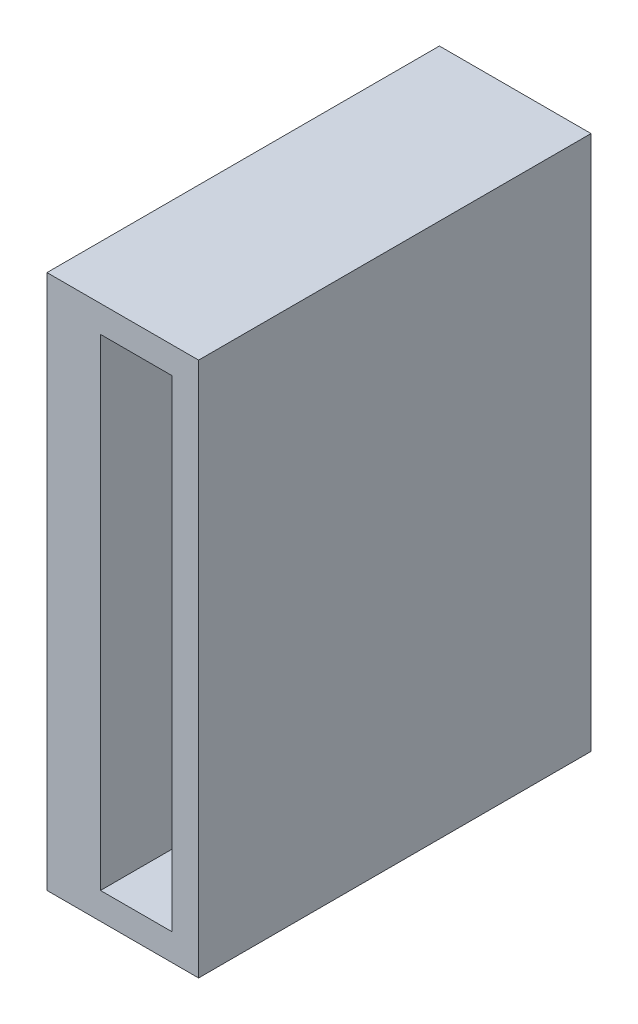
ISO-10303-21;
HEADER;
FILE_DESCRIPTION(('STEP AP214'),'2;1');
FILE_NAME('part.step','',(''),(''),'','','');
FILE_SCHEMA(('AUTOMOTIVE_DESIGN { 1 0 10303 214 1 1 1 1 }'));
ENDSEC;
DATA;
#1=APPLICATION_CONTEXT('core data for automotive mechanical design processes');
#2=APPLICATION_PROTOCOL_DEFINITION('international standard','automotive_design',2000,#1);
#3=PRODUCT_CONTEXT('',#1,'mechanical');
#4=PRODUCT('Part','Part','',(#3));
#5=PRODUCT_RELATED_PRODUCT_CATEGORY('part','',(#4));
#6=PRODUCT_DEFINITION_FORMATION('','',#4);
#7=PRODUCT_DEFINITION_CONTEXT('part definition',#1,'design');
#8=PRODUCT_DEFINITION('design','',#6,#7);
#9=PRODUCT_DEFINITION_SHAPE('','',#8);
#10=(LENGTH_UNIT() NAMED_UNIT(*) SI_UNIT(.MILLI.,.METRE.));
#11=(NAMED_UNIT(*) PLANE_ANGLE_UNIT() SI_UNIT($,.RADIAN.));
#12=(NAMED_UNIT(*) SI_UNIT($,.STERADIAN.) SOLID_ANGLE_UNIT());
#13=UNCERTAINTY_MEASURE_WITH_UNIT(LENGTH_MEASURE(1.E-05),#10,'distance_accuracy_value','');
#14=(GEOMETRIC_REPRESENTATION_CONTEXT(3) GLOBAL_UNCERTAINTY_ASSIGNED_CONTEXT((#13)) GLOBAL_UNIT_ASSIGNED_CONTEXT((#10,
#11,#12)) REPRESENTATION_CONTEXT('',''));
#15=CARTESIAN_POINT('',(0.,0.,0.));
#16=DIRECTION('',(0.,0.,1.));
#17=DIRECTION('',(1.,0.,0.));
#18=AXIS2_PLACEMENT_3D('',#15,#16,#17);
#19=CARTESIAN_POINT('',(0.333507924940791,7.82954545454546,22.));
#20=DIRECTION('',(1.,0.,0.));
#21=DIRECTION('',(0.,1.,0.));
#22=AXIS2_PLACEMENT_3D('',#19,#20,#21);
#23=PLANE('',#22);
#24=DIRECTION('',(0.,-1.,0.));
#25=VECTOR('',#24,1.);
#26=CARTESIAN_POINT('',(0.333507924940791,7.82954545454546,0.));
#27=LINE('',#26,#25);
#28=CARTESIAN_POINT('',(0.333507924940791,7.82954545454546,0.));
#29=VERTEX_POINT('',#28);
#30=CARTESIAN_POINT('',(0.333507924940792,-22.1704545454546,0.));
#31=VERTEX_POINT('',#30);
#32=EDGE_CURVE('E192',#29,#31,#27,.T.);
#33=ORIENTED_EDGE('',*,*,#32,.F.);
#34=DIRECTION('',(0.,0.,-1.));
#35=VECTOR('',#34,1.);
#36=CARTESIAN_POINT('',(0.333507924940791,7.82954545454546,22.));
#37=LINE('',#36,#35);
#38=CARTESIAN_POINT('',(0.333507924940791,7.82954545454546,22.));
#39=VERTEX_POINT('',#38);
#40=EDGE_CURVE('E11',#39,#29,#37,.T.);
#41=ORIENTED_EDGE('',*,*,#40,.F.);
#42=DIRECTION('',(0.,-1.,0.));
#43=VECTOR('',#42,1.);
#44=CARTESIAN_POINT('',(0.333507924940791,7.82954545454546,22.));
#45=LINE('',#44,#43);
#46=CARTESIAN_POINT('',(0.333507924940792,-22.1704545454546,22.));
#47=VERTEX_POINT('',#46);
#48=EDGE_CURVE('E199',#39,#47,#45,.T.);
#49=ORIENTED_EDGE('',*,*,#48,.T.);
#50=DIRECTION('',(0.,0.,-1.));
#51=VECTOR('',#50,1.);
#52=CARTESIAN_POINT('',(0.333507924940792,-22.1704545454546,22.));
#53=LINE('',#52,#51);
#54=EDGE_CURVE('E44',#47,#31,#53,.T.);
#55=ORIENTED_EDGE('',*,*,#54,.T.);
#56=EDGE_LOOP('',(#33,#41,#49,#55));
#57=FACE_BOUND('',#56,.T.);
#58=ADVANCED_FACE('F41',(#57),#23,.T.);
#59=CARTESIAN_POINT('',(0.333507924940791,7.82954545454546,22.));
#60=DIRECTION('',(0.,1.,0.));
#61=DIRECTION('',(0.,0.,1.));
#62=AXIS2_PLACEMENT_3D('',#59,#60,#61);
#63=PLANE('',#62);
#64=DIRECTION('',(1.,0.,0.));
#65=VECTOR('',#64,1.);
#66=CARTESIAN_POINT('',(0.333507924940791,7.82954545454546,0.));
#67=LINE('',#66,#65);
#68=CARTESIAN_POINT('',(-8.16649207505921,7.82954545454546,0.));
#69=VERTEX_POINT('',#68);
#70=EDGE_CURVE('E203',#69,#29,#67,.T.);
#71=ORIENTED_EDGE('',*,*,#70,.F.);
#72=DIRECTION('',(0.,0.,-1.));
#73=VECTOR('',#72,1.);
#74=CARTESIAN_POINT('',(-8.16649207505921,7.82954545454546,22.));
#75=LINE('',#74,#73);
#76=CARTESIAN_POINT('',(-8.16649207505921,7.82954545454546,22.));
#77=VERTEX_POINT('',#76);
#78=EDGE_CURVE('E49',#77,#69,#75,.T.);
#79=ORIENTED_EDGE('',*,*,#78,.F.);
#80=DIRECTION('',(1.,0.,0.));
#81=VECTOR('',#80,1.);
#82=CARTESIAN_POINT('',(0.333507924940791,7.82954545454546,22.));
#83=LINE('',#82,#81);
#84=EDGE_CURVE('E209',#77,#39,#83,.T.);
#85=ORIENTED_EDGE('',*,*,#84,.T.);
#86=ORIENTED_EDGE('',*,*,#40,.T.);
#87=EDGE_LOOP('',(#71,#79,#85,#86));
#88=FACE_BOUND('',#87,.T.);
#89=ADVANCED_FACE('F235',(#88),#63,.T.);
#90=CARTESIAN_POINT('',(-8.16649207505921,7.82954545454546,22.));
#91=DIRECTION('',(-1.,0.,0.));
#92=DIRECTION('',(0.,-1.,0.));
#93=AXIS2_PLACEMENT_3D('',#90,#91,#92);
#94=PLANE('',#93);
#95=DIRECTION('',(0.,1.,0.));
#96=VECTOR('',#95,1.);
#97=CARTESIAN_POINT('',(-8.16649207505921,7.82954545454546,0.));
#98=LINE('',#97,#96);
#99=CARTESIAN_POINT('',(-8.16649207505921,-22.1704545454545,0.));
#100=VERTEX_POINT('',#99);
#101=EDGE_CURVE('E217',#100,#69,#98,.T.);
#102=ORIENTED_EDGE('',*,*,#101,.F.);
#103=DIRECTION('',(0.,0.,-1.));
#104=VECTOR('',#103,1.);
#105=CARTESIAN_POINT('',(-8.16649207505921,-22.1704545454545,22.));
#106=LINE('',#105,#104);
#107=CARTESIAN_POINT('',(-8.16649207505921,-22.1704545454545,22.));
#108=VERTEX_POINT('',#107);
#109=EDGE_CURVE('E222',#108,#100,#106,.T.);
#110=ORIENTED_EDGE('',*,*,#109,.F.);
#111=DIRECTION('',(0.,1.,0.));
#112=VECTOR('',#111,1.);
#113=CARTESIAN_POINT('',(-8.16649207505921,7.82954545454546,22.));
#114=LINE('',#113,#112);
#115=EDGE_CURVE('E206',#108,#77,#114,.T.);
#116=ORIENTED_EDGE('',*,*,#115,.T.);
#117=ORIENTED_EDGE('',*,*,#78,.T.);
#118=EDGE_LOOP('',(#102,#110,#116,#117));
#119=FACE_BOUND('',#118,.T.);
#120=ADVANCED_FACE('F241',(#119),#94,.T.);
#121=CARTESIAN_POINT('',(0.333507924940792,-22.1704545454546,22.));
#122=DIRECTION('',(0.,-1.,0.));
#123=DIRECTION('',(1.,0.,0.));
#124=AXIS2_PLACEMENT_3D('',#121,#122,#123);
#125=PLANE('',#124);
#126=DIRECTION('',(-1.,0.,0.));
#127=VECTOR('',#126,1.);
#128=CARTESIAN_POINT('',(0.333507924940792,-22.1704545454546,0.));
#129=LINE('',#128,#127);
#130=EDGE_CURVE('E214',#31,#100,#129,.T.);
#131=ORIENTED_EDGE('',*,*,#130,.F.);
#132=ORIENTED_EDGE('',*,*,#54,.F.);
#133=DIRECTION('',(-1.,0.,0.));
#134=VECTOR('',#133,1.);
#135=CARTESIAN_POINT('',(0.333507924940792,-22.1704545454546,22.));
#136=LINE('',#135,#134);
#137=EDGE_CURVE('E202',#47,#108,#136,.T.);
#138=ORIENTED_EDGE('',*,*,#137,.T.);
#139=ORIENTED_EDGE('',*,*,#109,.T.);
#140=EDGE_LOOP('',(#131,#132,#138,#139));
#141=FACE_BOUND('',#140,.T.);
#142=ADVANCED_FACE('F230',(#141),#125,.T.);
#143=CARTESIAN_POINT('',(0.,0.,22.));
#144=DIRECTION('',(0.,0.,-1.));
#145=DIRECTION('',(-1.,0.,0.));
#146=AXIS2_PLACEMENT_3D('',#143,#144,#145);
#147=PLANE('',#146);
#148=DIRECTION('',(1.,0.,0.));
#149=VECTOR('',#148,1.);
#150=CARTESIAN_POINT('',(-1.16649207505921,6.32954545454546,22.));
#151=LINE('',#150,#149);
#152=CARTESIAN_POINT('',(-5.16649207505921,6.32954545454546,22.));
#153=VERTEX_POINT('',#152);
#154=CARTESIAN_POINT('',(-1.16649207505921,6.32954545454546,22.));
#155=VERTEX_POINT('',#154);
#156=EDGE_CURVE('E177',#153,#155,#151,.T.);
#157=ORIENTED_EDGE('',*,*,#156,.T.);
#158=DIRECTION('',(0.,-1.,0.));
#159=VECTOR('',#158,1.);
#160=CARTESIAN_POINT('',(-1.16649207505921,6.32954545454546,22.));
#161=LINE('',#160,#159);
#162=CARTESIAN_POINT('',(-1.16649207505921,-20.6704545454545,22.));
#163=VERTEX_POINT('',#162);
#164=EDGE_CURVE('E169',#155,#163,#161,.T.);
#165=ORIENTED_EDGE('',*,*,#164,.T.);
#166=DIRECTION('',(-1.,0.,0.));
#167=VECTOR('',#166,1.);
#168=CARTESIAN_POINT('',(-1.16649207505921,-20.6704545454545,22.));
#169=LINE('',#168,#167);
#170=CARTESIAN_POINT('',(-5.16649207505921,-20.6704545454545,22.));
#171=VERTEX_POINT('',#170);
#172=EDGE_CURVE('E172',#163,#171,#169,.T.);
#173=ORIENTED_EDGE('',*,*,#172,.T.);
#174=DIRECTION('',(0.,1.,0.));
#175=VECTOR('',#174,1.);
#176=CARTESIAN_POINT('',(-5.16649207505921,6.32954545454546,22.));
#177=LINE('',#176,#175);
#178=EDGE_CURVE('E65',#171,#153,#177,.T.);
#179=ORIENTED_EDGE('',*,*,#178,.T.);
#180=EDGE_LOOP('',(#157,#165,#173,#179));
#181=FACE_BOUND('',#180,.T.);
#182=ORIENTED_EDGE('',*,*,#48,.F.);
#183=ORIENTED_EDGE('',*,*,#84,.F.);
#184=ORIENTED_EDGE('',*,*,#115,.F.);
#185=ORIENTED_EDGE('',*,*,#137,.F.);
#186=EDGE_LOOP('',(#182,#183,#184,#185));
#187=FACE_BOUND('',#186,.T.);
#188=ADVANCED_FACE('F238',(#181,#187),#147,.F.);
#189=CARTESIAN_POINT('',(0.,0.,0.));
#190=DIRECTION('',(0.,0.,-1.));
#191=DIRECTION('',(-1.,0.,0.));
#192=AXIS2_PLACEMENT_3D('',#189,#190,#191);
#193=PLANE('',#192);
#194=DIRECTION('',(0.,-1.,0.));
#195=VECTOR('',#194,1.);
#196=CARTESIAN_POINT('',(-5.66649207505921,2.82954545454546,0.));
#197=LINE('',#196,#195);
#198=CARTESIAN_POINT('',(-5.66649207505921,2.82954545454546,0.));
#199=VERTEX_POINT('',#198);
#200=CARTESIAN_POINT('',(-5.66649207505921,-17.1704545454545,0.));
#201=VERTEX_POINT('',#200);
#202=EDGE_CURVE('E57',#199,#201,#197,.T.);
#203=ORIENTED_EDGE('',*,*,#202,.F.);
#204=DIRECTION('',(1.,0.,0.));
#205=VECTOR('',#204,1.);
#206=CARTESIAN_POINT('',(-5.66649207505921,2.82954545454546,0.));
#207=LINE('',#206,#205);
#208=CARTESIAN_POINT('',(-7.66649207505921,2.82954545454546,0.));
#209=VERTEX_POINT('',#208);
#210=EDGE_CURVE('E150',#209,#199,#207,.T.);
#211=ORIENTED_EDGE('',*,*,#210,.F.);
#212=DIRECTION('',(0.,1.,0.));
#213=VECTOR('',#212,1.);
#214=CARTESIAN_POINT('',(-7.66649207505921,2.82954545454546,0.));
#215=LINE('',#214,#213);
#216=CARTESIAN_POINT('',(-7.66649207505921,-17.1704545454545,0.));
#217=VERTEX_POINT('',#216);
#218=EDGE_CURVE('E153',#217,#209,#215,.T.);
#219=ORIENTED_EDGE('',*,*,#218,.F.);
#220=DIRECTION('',(-1.,0.,0.));
#221=VECTOR('',#220,1.);
#222=CARTESIAN_POINT('',(-5.66649207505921,-17.1704545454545,0.));
#223=LINE('',#222,#221);
#224=EDGE_CURVE('E159',#201,#217,#223,.T.);
#225=ORIENTED_EDGE('',*,*,#224,.F.);
#226=EDGE_LOOP('',(#203,#211,#219,#225));
#227=FACE_BOUND('',#226,.T.);
#228=DIRECTION('',(0.,-1.,0.));
#229=VECTOR('',#228,1.);
#230=CARTESIAN_POINT('',(-1.16649207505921,6.32954545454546,0.));
#231=LINE('',#230,#229);
#232=CARTESIAN_POINT('',(-1.16649207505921,6.32954545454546,0.));
#233=VERTEX_POINT('',#232);
#234=CARTESIAN_POINT('',(-1.16649207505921,-20.6704545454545,0.));
#235=VERTEX_POINT('',#234);
#236=EDGE_CURVE('E165',#233,#235,#231,.T.);
#237=ORIENTED_EDGE('',*,*,#236,.F.);
#238=DIRECTION('',(1.,0.,0.));
#239=VECTOR('',#238,1.);
#240=CARTESIAN_POINT('',(-1.16649207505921,6.32954545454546,0.));
#241=LINE('',#240,#239);
#242=CARTESIAN_POINT('',(-5.16649207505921,6.32954545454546,0.));
#243=VERTEX_POINT('',#242);
#244=EDGE_CURVE('E173',#243,#233,#241,.T.);
#245=ORIENTED_EDGE('',*,*,#244,.F.);
#246=DIRECTION('',(0.,1.,0.));
#247=VECTOR('',#246,1.);
#248=CARTESIAN_POINT('',(-5.16649207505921,6.32954545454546,0.));
#249=LINE('',#248,#247);
#250=CARTESIAN_POINT('',(-5.16649207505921,-20.6704545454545,0.));
#251=VERTEX_POINT('',#250);
#252=EDGE_CURVE('E185',#251,#243,#249,.T.);
#253=ORIENTED_EDGE('',*,*,#252,.F.);
#254=DIRECTION('',(-1.,0.,0.));
#255=VECTOR('',#254,1.);
#256=CARTESIAN_POINT('',(-1.16649207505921,-20.6704545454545,0.));
#257=LINE('',#256,#255);
#258=EDGE_CURVE('E182',#235,#251,#257,.T.);
#259=ORIENTED_EDGE('',*,*,#258,.F.);
#260=EDGE_LOOP('',(#237,#245,#253,#259));
#261=FACE_BOUND('',#260,.T.);
#262=ORIENTED_EDGE('',*,*,#32,.T.);
#263=ORIENTED_EDGE('',*,*,#130,.T.);
#264=ORIENTED_EDGE('',*,*,#101,.T.);
#265=ORIENTED_EDGE('',*,*,#70,.T.);
#266=EDGE_LOOP('',(#262,#263,#264,#265));
#267=FACE_BOUND('',#266,.T.);
#268=ADVANCED_FACE('F232',(#227,#261,#267),#193,.T.);
#269=CARTESIAN_POINT('',(-1.16649207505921,6.32954545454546,22.));
#270=DIRECTION('',(1.,0.,0.));
#271=DIRECTION('',(0.,1.,0.));
#272=AXIS2_PLACEMENT_3D('',#269,#270,#271);
#273=PLANE('',#272);
#274=ORIENTED_EDGE('',*,*,#236,.T.);
#275=DIRECTION('',(0.,0.,-1.));
#276=VECTOR('',#275,1.);
#277=CARTESIAN_POINT('',(-1.16649207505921,-20.6704545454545,22.));
#278=LINE('',#277,#276);
#279=EDGE_CURVE('E180',#163,#235,#278,.T.);
#280=ORIENTED_EDGE('',*,*,#279,.F.);
#281=ORIENTED_EDGE('',*,*,#164,.F.);
#282=DIRECTION('',(0.,0.,-1.));
#283=VECTOR('',#282,1.);
#284=CARTESIAN_POINT('',(-1.16649207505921,6.32954545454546,22.));
#285=LINE('',#284,#283);
#286=EDGE_CURVE('E190',#155,#233,#285,.T.);
#287=ORIENTED_EDGE('',*,*,#286,.T.);
#288=EDGE_LOOP('',(#274,#280,#281,#287));
#289=FACE_BOUND('',#288,.T.);
#290=ADVANCED_FACE('F287',(#289),#273,.F.);
#291=CARTESIAN_POINT('',(-1.16649207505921,6.32954545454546,22.));
#292=DIRECTION('',(0.,1.,0.));
#293=DIRECTION('',(0.,0.,1.));
#294=AXIS2_PLACEMENT_3D('',#291,#292,#293);
#295=PLANE('',#294);
#296=ORIENTED_EDGE('',*,*,#244,.T.);
#297=ORIENTED_EDGE('',*,*,#286,.F.);
#298=ORIENTED_EDGE('',*,*,#156,.F.);
#299=DIRECTION('',(0.,0.,-1.));
#300=VECTOR('',#299,1.);
#301=CARTESIAN_POINT('',(-5.16649207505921,6.32954545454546,22.));
#302=LINE('',#301,#300);
#303=EDGE_CURVE('E193',#153,#243,#302,.T.);
#304=ORIENTED_EDGE('',*,*,#303,.T.);
#305=EDGE_LOOP('',(#296,#297,#298,#304));
#306=FACE_BOUND('',#305,.T.);
#307=ADVANCED_FACE('F298',(#306),#295,.F.);
#308=CARTESIAN_POINT('',(-5.16649207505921,6.32954545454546,22.));
#309=DIRECTION('',(-1.,0.,0.));
#310=DIRECTION('',(0.,-1.,0.));
#311=AXIS2_PLACEMENT_3D('',#308,#309,#310);
#312=PLANE('',#311);
#313=ORIENTED_EDGE('',*,*,#252,.T.);
#314=ORIENTED_EDGE('',*,*,#303,.F.);
#315=ORIENTED_EDGE('',*,*,#178,.F.);
#316=DIRECTION('',(0.,0.,-1.));
#317=VECTOR('',#316,1.);
#318=CARTESIAN_POINT('',(-5.16649207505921,-20.6704545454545,22.));
#319=LINE('',#318,#317);
#320=EDGE_CURVE('E195',#171,#251,#319,.T.);
#321=ORIENTED_EDGE('',*,*,#320,.T.);
#322=EDGE_LOOP('',(#313,#314,#315,#321));
#323=FACE_BOUND('',#322,.T.);
#324=ADVANCED_FACE('F308',(#323),#312,.F.);
#325=CARTESIAN_POINT('',(-1.16649207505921,-20.6704545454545,22.));
#326=DIRECTION('',(0.,-1.,0.));
#327=DIRECTION('',(0.,0.,-1.));
#328=AXIS2_PLACEMENT_3D('',#325,#326,#327);
#329=PLANE('',#328);
#330=ORIENTED_EDGE('',*,*,#258,.T.);
#331=ORIENTED_EDGE('',*,*,#320,.F.);
#332=ORIENTED_EDGE('',*,*,#172,.F.);
#333=ORIENTED_EDGE('',*,*,#279,.T.);
#334=EDGE_LOOP('',(#330,#331,#332,#333));
#335=FACE_BOUND('',#334,.T.);
#336=ADVANCED_FACE('F318',(#335),#329,.F.);
#337=CARTESIAN_POINT('',(-5.66649207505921,2.82954545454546,21.));
#338=DIRECTION('',(1.,0.,0.));
#339=DIRECTION('',(0.,1.,0.));
#340=AXIS2_PLACEMENT_3D('',#337,#338,#339);
#341=PLANE('',#340);
#342=ORIENTED_EDGE('',*,*,#202,.T.);
#343=DIRECTION('',(0.,0.,-1.));
#344=VECTOR('',#343,1.);
#345=CARTESIAN_POINT('',(-5.66649207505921,-17.1704545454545,21.));
#346=LINE('',#345,#344);
#347=CARTESIAN_POINT('',(-5.66649207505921,-17.1704545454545,21.));
#348=VERTEX_POINT('',#347);
#349=EDGE_CURVE('E128',#348,#201,#346,.T.);
#350=ORIENTED_EDGE('',*,*,#349,.F.);
#351=DIRECTION('',(0.,-1.,0.));
#352=VECTOR('',#351,1.);
#353=CARTESIAN_POINT('',(-5.66649207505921,2.82954545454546,21.));
#354=LINE('',#353,#352);
#355=CARTESIAN_POINT('',(-5.66649207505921,2.82954545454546,21.));
#356=VERTEX_POINT('',#355);
#357=EDGE_CURVE('E132',#356,#348,#354,.T.);
#358=ORIENTED_EDGE('',*,*,#357,.F.);
#359=DIRECTION('',(0.,0.,-1.));
#360=VECTOR('',#359,1.);
#361=CARTESIAN_POINT('',(-5.66649207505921,2.82954545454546,21.));
#362=LINE('',#361,#360);
#363=EDGE_CURVE('E163',#356,#199,#362,.T.);
#364=ORIENTED_EDGE('',*,*,#363,.T.);
#365=EDGE_LOOP('',(#342,#350,#358,#364));
#366=FACE_BOUND('',#365,.T.);
#367=ADVANCED_FACE('F130',(#366),#341,.F.);
#368=CARTESIAN_POINT('',(-5.66649207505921,2.82954545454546,21.));
#369=DIRECTION('',(0.,1.,0.));
#370=DIRECTION('',(0.,0.,1.));
#371=AXIS2_PLACEMENT_3D('',#368,#369,#370);
#372=PLANE('',#371);
#373=ORIENTED_EDGE('',*,*,#210,.T.);
#374=ORIENTED_EDGE('',*,*,#363,.F.);
#375=DIRECTION('',(1.,0.,0.));
#376=VECTOR('',#375,1.);
#377=CARTESIAN_POINT('',(-5.66649207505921,2.82954545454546,21.));
#378=LINE('',#377,#376);
#379=CARTESIAN_POINT('',(-7.66649207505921,2.82954545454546,21.));
#380=VERTEX_POINT('',#379);
#381=EDGE_CURVE('E138',#380,#356,#378,.T.);
#382=ORIENTED_EDGE('',*,*,#381,.F.);
#383=DIRECTION('',(0.,0.,-1.));
#384=VECTOR('',#383,1.);
#385=CARTESIAN_POINT('',(-7.66649207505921,2.82954545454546,21.));
#386=LINE('',#385,#384);
#387=EDGE_CURVE('E166',#380,#209,#386,.T.);
#388=ORIENTED_EDGE('',*,*,#387,.T.);
#389=EDGE_LOOP('',(#373,#374,#382,#388));
#390=FACE_BOUND('',#389,.T.);
#391=ADVANCED_FACE('F334',(#390),#372,.F.);
#392=CARTESIAN_POINT('',(-7.66649207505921,2.82954545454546,21.));
#393=DIRECTION('',(-1.,0.,0.));
#394=DIRECTION('',(0.,-1.,0.));
#395=AXIS2_PLACEMENT_3D('',#392,#393,#394);
#396=PLANE('',#395);
#397=ORIENTED_EDGE('',*,*,#218,.T.);
#398=ORIENTED_EDGE('',*,*,#387,.F.);
#399=DIRECTION('',(0.,1.,0.));
#400=VECTOR('',#399,1.);
#401=CARTESIAN_POINT('',(-7.66649207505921,2.82954545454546,21.));
#402=LINE('',#401,#400);
#403=CARTESIAN_POINT('',(-7.66649207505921,-17.1704545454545,21.));
#404=VERTEX_POINT('',#403);
#405=EDGE_CURVE('E146',#404,#380,#402,.T.);
#406=ORIENTED_EDGE('',*,*,#405,.F.);
#407=DIRECTION('',(0.,0.,-1.));
#408=VECTOR('',#407,1.);
#409=CARTESIAN_POINT('',(-7.66649207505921,-17.1704545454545,21.));
#410=LINE('',#409,#408);
#411=EDGE_CURVE('E137',#404,#217,#410,.T.);
#412=ORIENTED_EDGE('',*,*,#411,.T.);
#413=EDGE_LOOP('',(#397,#398,#406,#412));
#414=FACE_BOUND('',#413,.T.);
#415=ADVANCED_FACE('F343',(#414),#396,.F.);
#416=CARTESIAN_POINT('',(-5.66649207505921,-17.1704545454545,21.));
#417=DIRECTION('',(0.,-1.,0.));
#418=DIRECTION('',(0.,0.,-1.));
#419=AXIS2_PLACEMENT_3D('',#416,#417,#418);
#420=PLANE('',#419);
#421=ORIENTED_EDGE('',*,*,#224,.T.);
#422=ORIENTED_EDGE('',*,*,#411,.F.);
#423=DIRECTION('',(-1.,0.,0.));
#424=VECTOR('',#423,1.);
#425=CARTESIAN_POINT('',(-5.66649207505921,-17.1704545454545,21.));
#426=LINE('',#425,#424);
#427=EDGE_CURVE('E141',#348,#404,#426,.T.);
#428=ORIENTED_EDGE('',*,*,#427,.F.);
#429=ORIENTED_EDGE('',*,*,#349,.T.);
#430=EDGE_LOOP('',(#421,#422,#428,#429));
#431=FACE_BOUND('',#430,.T.);
#432=ADVANCED_FACE('F142',(#431),#420,.F.);
#433=CARTESIAN_POINT('',(0.,0.,21.));
#434=DIRECTION('',(0.,0.,-1.));
#435=DIRECTION('',(-1.,0.,0.));
#436=AXIS2_PLACEMENT_3D('',#433,#434,#435);
#437=PLANE('',#436);
#438=ORIENTED_EDGE('',*,*,#357,.T.);
#439=ORIENTED_EDGE('',*,*,#427,.T.);
#440=ORIENTED_EDGE('',*,*,#405,.T.);
#441=ORIENTED_EDGE('',*,*,#381,.T.);
#442=EDGE_LOOP('',(#438,#439,#440,#441));
#443=FACE_BOUND('',#442,.T.);
#444=ADVANCED_FACE('F148',(#443),#437,.T.);
#445=CLOSED_SHELL('',(#58,#89,#120,#142,#188,#268,#290,#307,#324,#336,#367,#391,#415,#432,#444));
#446=MANIFOLD_SOLID_BREP('B2',#445);
#447=ADVANCED_BREP_SHAPE_REPRESENTATION('',(#18,#446),#14);
#448=SHAPE_DEFINITION_REPRESENTATION(#9,#447);
ENDSEC;
END-ISO-10303-21;
